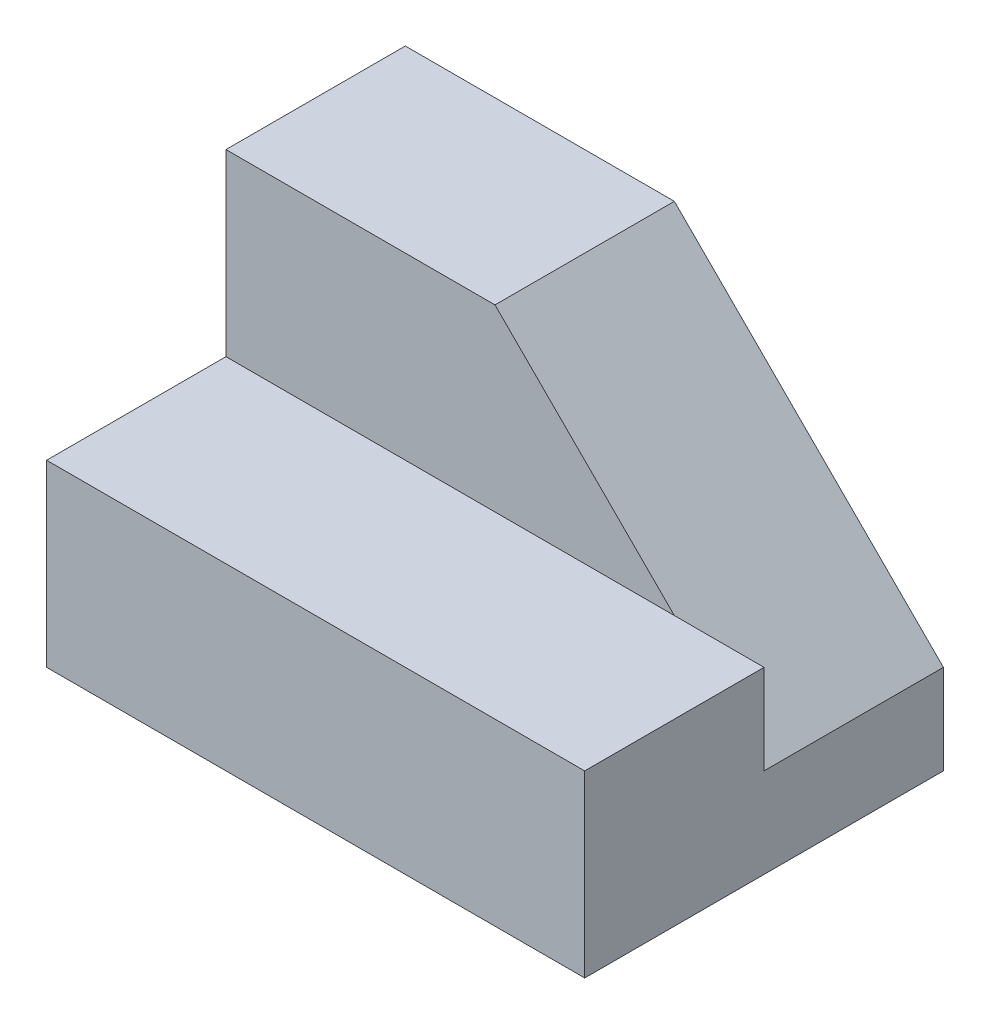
from build123d import *

# Parameters (mm, degrees)
SKETCH1_W      = 60
SKETCH1_H      = 40
EXTRUDE1_DEPTH = 40
SKETCH2_W      = 60
SKETCH2_H      = 20
EXTRUDE2_DEPTH = 20
EXTRUDE3_DEPTH = 20


with BuildPart() as part:
    # Sketch1 → Extrude1 (new body)
    with BuildSketch(Plane(origin=(0, 0, 0), x_dir=(1, 0, 0), z_dir=(0, 1, 0))):
        Rectangle(SKETCH1_W, SKETCH1_H)
    extrude(amount=EXTRUDE1_DEPTH)

    # Sketch2 → Extrude2 (cut)
    with BuildSketch(Plane.XY.offset(20)):
        with Locations((0, 30)):
            Rectangle(SKETCH2_W, SKETCH2_H)
    extrude(amount=-EXTRUDE2_DEPTH, mode=Mode.SUBTRACT)

    # Sketch3 → Extrude3 (cut)
    with BuildSketch(Plane(origin=(0, 0, -20), x_dir=(-1, 0, 0), z_dir=(0, 0, -1))):
        Polygon((0, 40), (-30, 10), (-30, 40), align=None)
    extrude(amount=-EXTRUDE3_DEPTH, mode=Mode.SUBTRACT)


solid = part.part
